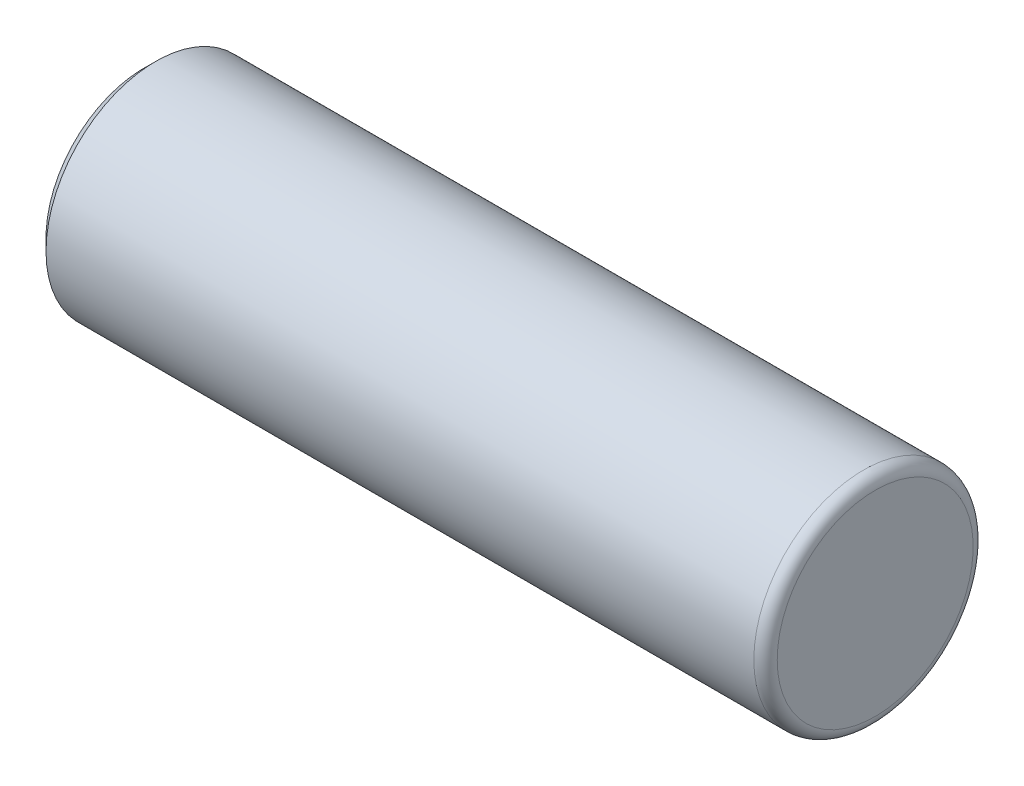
from build123d import *

# Parameters (mm, degrees)
SKETCH2_W     = 31.75
SKETCH2_H     = 4.7625
CHAMFER1_SIZE = 0.508
FILLET1_R     = 0.508


with BuildPart() as part:
    # Sketch2 → Revolve1 (revolve)
    with BuildSketch(Plane.XY, mode=Mode.PRIVATE) as revolve1_sk:
        with Locations((-15.875, 2.38125)):
            Rectangle(SKETCH2_W, SKETCH2_H)
    revolve(revolve1_sk.sketch.rotate(Axis((-14.156533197, 0, 0), (1, 0, 0)), 90), axis=Axis((-14.156533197, 0, 0), (1, 0, 0)))

    # Chamfer1
    chamfer1_edges = [part.edges().sort_by_distance(p)[0] for p in [
        (-31.75, 0, -4.7625),
    ]]
    chamfer(chamfer1_edges, length=CHAMFER1_SIZE)

    # Fillet1
    fillet1_edges = [part.edges().sort_by_distance(p)[0] for p in [
        (0, 0, -4.7625),
    ]]
    fillet(fillet1_edges, radius=FILLET1_R)


solid = part.part
